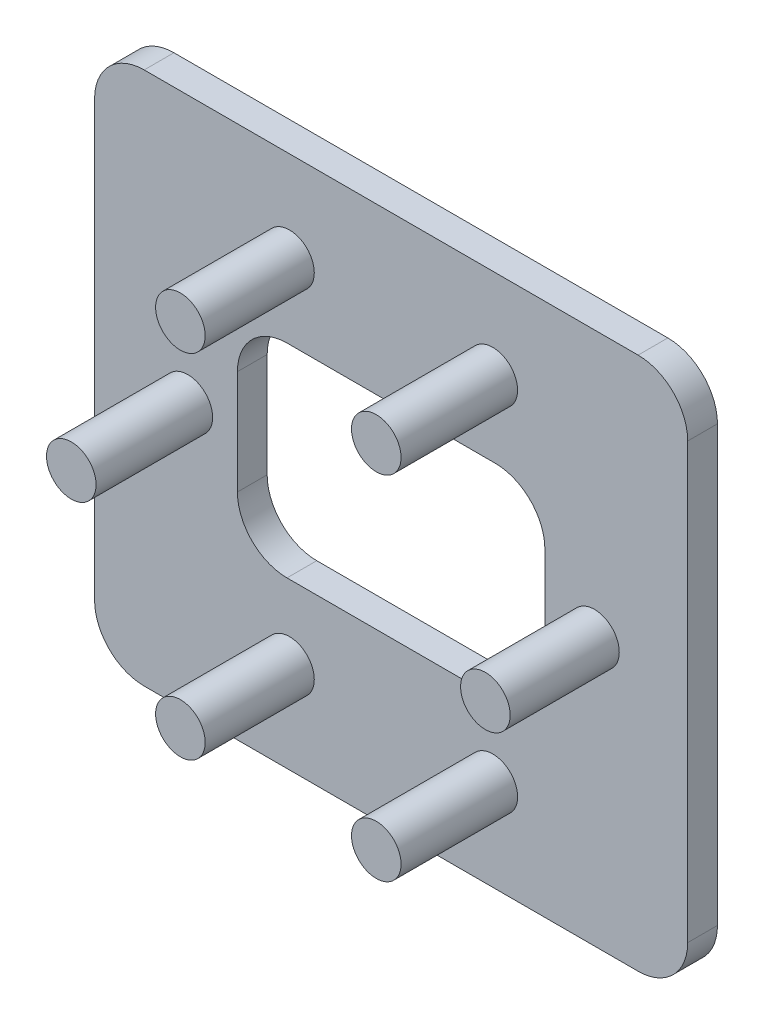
ISO-10303-21;
HEADER;
FILE_DESCRIPTION(('STEP AP214'),'2;1');
FILE_NAME('part.step','',(''),(''),'','','');
FILE_SCHEMA(('AUTOMOTIVE_DESIGN { 1 0 10303 214 1 1 1 1 }'));
ENDSEC;
DATA;
#1=APPLICATION_CONTEXT('core data for automotive mechanical design processes');
#2=APPLICATION_PROTOCOL_DEFINITION('international standard','automotive_design',2000,#1);
#3=PRODUCT_CONTEXT('',#1,'mechanical');
#4=PRODUCT('Part','Part','',(#3));
#5=PRODUCT_RELATED_PRODUCT_CATEGORY('part','',(#4));
#6=PRODUCT_DEFINITION_FORMATION('','',#4);
#7=PRODUCT_DEFINITION_CONTEXT('part definition',#1,'design');
#8=PRODUCT_DEFINITION('design','',#6,#7);
#9=PRODUCT_DEFINITION_SHAPE('','',#8);
#10=(LENGTH_UNIT() NAMED_UNIT(*) SI_UNIT(.MILLI.,.METRE.));
#11=(NAMED_UNIT(*) PLANE_ANGLE_UNIT() SI_UNIT($,.RADIAN.));
#12=(NAMED_UNIT(*) SI_UNIT($,.STERADIAN.) SOLID_ANGLE_UNIT());
#13=UNCERTAINTY_MEASURE_WITH_UNIT(LENGTH_MEASURE(1.E-05),#10,'distance_accuracy_value','');
#14=(GEOMETRIC_REPRESENTATION_CONTEXT(3) GLOBAL_UNCERTAINTY_ASSIGNED_CONTEXT((#13)) GLOBAL_UNIT_ASSIGNED_CONTEXT((#10,
#11,#12)) REPRESENTATION_CONTEXT('',''));
#15=CARTESIAN_POINT('',(0.,0.,0.));
#16=DIRECTION('',(0.,0.,1.));
#17=DIRECTION('',(1.,0.,0.));
#18=AXIS2_PLACEMENT_3D('',#15,#16,#17);
#19=CARTESIAN_POINT('',(-10.2500000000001,-17.7535207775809,14.));
#20=DIRECTION('',(0.,0.,-1.));
#21=DIRECTION('',(-1.,0.,0.));
#22=AXIS2_PLACEMENT_3D('',#19,#20,#21);
#23=CYLINDRICAL_SURFACE('',#22,2.5);
#24=CARTESIAN_POINT('',(-10.2500000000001,-17.7535207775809,14.));
#25=DIRECTION('',(0.,0.,1.));
#26=DIRECTION('',(1.,0.,0.));
#27=AXIS2_PLACEMENT_3D('',#24,#25,#26);
#28=CIRCLE('',#27,2.5);
#29=CARTESIAN_POINT('',(-7.75000000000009,-17.7535207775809,14.));
#30=VERTEX_POINT('',#29);
#31=EDGE_CURVE('E194',#30,#30,#28,.T.);
#32=ORIENTED_EDGE('',*,*,#31,.F.);
#33=EDGE_LOOP('',(#32));
#34=FACE_BOUND('',#33,.T.);
#35=CARTESIAN_POINT('',(-10.2500000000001,-17.7535207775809,0.));
#36=DIRECTION('',(0.,0.,1.));
#37=DIRECTION('',(1.,0.,0.));
#38=AXIS2_PLACEMENT_3D('',#35,#36,#37);
#39=CIRCLE('',#38,2.5);
#40=CARTESIAN_POINT('',(-7.75000000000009,-17.7535207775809,0.));
#41=VERTEX_POINT('',#40);
#42=EDGE_CURVE('E12',#41,#41,#39,.T.);
#43=ORIENTED_EDGE('',*,*,#42,.T.);
#44=EDGE_LOOP('',(#43));
#45=FACE_BOUND('',#44,.T.);
#46=ADVANCED_FACE('F190',(#34,#45),#23,.T.);
#47=CARTESIAN_POINT('',(-10.2500000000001,-17.7535207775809,14.));
#48=DIRECTION('',(0.,0.,1.));
#49=DIRECTION('',(1.,0.,0.));
#50=AXIS2_PLACEMENT_3D('',#47,#48,#49);
#51=PLANE('',#50);
#52=ORIENTED_EDGE('',*,*,#31,.T.);
#53=EDGE_LOOP('',(#52));
#54=FACE_BOUND('',#53,.T.);
#55=ADVANCED_FACE('F192',(#54),#51,.T.);
#56=CARTESIAN_POINT('',(-10.2500000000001,-17.7535207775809,0.));
#57=DIRECTION('',(0.,0.,1.));
#58=DIRECTION('',(1.,0.,0.));
#59=AXIS2_PLACEMENT_3D('',#56,#57,#58);
#60=PLANE('',#59);
#61=ORIENTED_EDGE('',*,*,#42,.F.);
#62=EDGE_LOOP('',(#61));
#63=FACE_BOUND('',#62,.T.);
#64=ADVANCED_FACE('F209',(#63),#60,.F.);
#65=CLOSED_SHELL('',(#46,#55,#64));
#66=MANIFOLD_SOLID_BREP('B2',#65);
#67=CARTESIAN_POINT('',(10.2500000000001,17.7535207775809,14.));
#68=DIRECTION('',(0.,0.,-1.));
#69=DIRECTION('',(-1.,0.,0.));
#70=AXIS2_PLACEMENT_3D('',#67,#68,#69);
#71=CYLINDRICAL_SURFACE('',#70,2.5);
#72=CARTESIAN_POINT('',(10.2500000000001,17.7535207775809,14.75));
#73=DIRECTION('',(0.,0.,1.));
#74=DIRECTION('',(1.,0.,0.));
#75=AXIS2_PLACEMENT_3D('',#72,#73,#74);
#76=CIRCLE('',#75,2.5);
#77=CARTESIAN_POINT('',(12.7500000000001,17.7535207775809,14.75));
#78=VERTEX_POINT('',#77);
#79=EDGE_CURVE('E252',#78,#78,#76,.T.);
#80=ORIENTED_EDGE('',*,*,#79,.F.);
#81=EDGE_LOOP('',(#80));
#82=FACE_BOUND('',#81,.T.);
#83=CARTESIAN_POINT('',(10.2500000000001,17.7535207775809,0.));
#84=DIRECTION('',(0.,0.,1.));
#85=DIRECTION('',(1.,0.,0.));
#86=AXIS2_PLACEMENT_3D('',#83,#84,#85);
#87=CIRCLE('',#86,2.5);
#88=CARTESIAN_POINT('',(12.7500000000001,17.7535207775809,0.));
#89=VERTEX_POINT('',#88);
#90=EDGE_CURVE('E189',#89,#89,#87,.T.);
#91=ORIENTED_EDGE('',*,*,#90,.T.);
#92=EDGE_LOOP('',(#91));
#93=FACE_BOUND('',#92,.T.);
#94=ADVANCED_FACE('F245',(#82,#93),#71,.T.);
#95=CARTESIAN_POINT('',(10.2500000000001,17.7535207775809,0.));
#96=DIRECTION('',(0.,0.,1.));
#97=DIRECTION('',(1.,0.,0.));
#98=AXIS2_PLACEMENT_3D('',#95,#96,#97);
#99=PLANE('',#98);
#100=ORIENTED_EDGE('',*,*,#90,.F.);
#101=EDGE_LOOP('',(#100));
#102=FACE_BOUND('',#101,.T.);
#103=ADVANCED_FACE('F247',(#102),#99,.F.);
#104=CARTESIAN_POINT('',(10.2500000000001,17.7535207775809,14.75));
#105=DIRECTION('',(0.,0.,1.));
#106=DIRECTION('',(1.,0.,0.));
#107=AXIS2_PLACEMENT_3D('',#104,#105,#106);
#108=PLANE('',#107);
#109=ORIENTED_EDGE('',*,*,#79,.T.);
#110=EDGE_LOOP('',(#109));
#111=FACE_BOUND('',#110,.T.);
#112=ADVANCED_FACE('F258',(#111),#108,.T.);
#113=CLOSED_SHELL('',(#94,#103,#112));
#114=MANIFOLD_SOLID_BREP('B7',#113);
#115=CARTESIAN_POINT('',(-10.2499999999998,17.7535207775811,14.));
#116=DIRECTION('',(0.,0.,-1.));
#117=DIRECTION('',(-1.,0.,0.));
#118=AXIS2_PLACEMENT_3D('',#115,#116,#117);
#119=CYLINDRICAL_SURFACE('',#118,2.5);
#120=CARTESIAN_POINT('',(-10.2499999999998,17.7535207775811,14.));
#121=DIRECTION('',(0.,0.,1.));
#122=DIRECTION('',(1.,0.,0.));
#123=AXIS2_PLACEMENT_3D('',#120,#121,#122);
#124=CIRCLE('',#123,2.5);
#125=CARTESIAN_POINT('',(-7.74999999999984,17.7535207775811,14.));
#126=VERTEX_POINT('',#125);
#127=EDGE_CURVE('E307',#126,#126,#124,.T.);
#128=ORIENTED_EDGE('',*,*,#127,.F.);
#129=EDGE_LOOP('',(#128));
#130=FACE_BOUND('',#129,.T.);
#131=CARTESIAN_POINT('',(-10.2499999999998,17.7535207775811,0.));
#132=DIRECTION('',(0.,0.,1.));
#133=DIRECTION('',(1.,0.,0.));
#134=AXIS2_PLACEMENT_3D('',#131,#132,#133);
#135=CIRCLE('',#134,2.5);
#136=CARTESIAN_POINT('',(-7.74999999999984,17.7535207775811,0.));
#137=VERTEX_POINT('',#136);
#138=EDGE_CURVE('E244',#137,#137,#135,.T.);
#139=ORIENTED_EDGE('',*,*,#138,.T.);
#140=EDGE_LOOP('',(#139));
#141=FACE_BOUND('',#140,.T.);
#142=ADVANCED_FACE('F303',(#130,#141),#119,.T.);
#143=CARTESIAN_POINT('',(-10.2499999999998,17.7535207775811,14.));
#144=DIRECTION('',(0.,0.,1.));
#145=DIRECTION('',(1.,0.,0.));
#146=AXIS2_PLACEMENT_3D('',#143,#144,#145);
#147=PLANE('',#146);
#148=ORIENTED_EDGE('',*,*,#127,.T.);
#149=EDGE_LOOP('',(#148));
#150=FACE_BOUND('',#149,.T.);
#151=ADVANCED_FACE('F305',(#150),#147,.T.);
#152=CARTESIAN_POINT('',(-10.2499999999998,17.7535207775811,0.));
#153=DIRECTION('',(0.,0.,1.));
#154=DIRECTION('',(1.,0.,0.));
#155=AXIS2_PLACEMENT_3D('',#152,#153,#154);
#156=PLANE('',#155);
#157=ORIENTED_EDGE('',*,*,#138,.F.);
#158=EDGE_LOOP('',(#157));
#159=FACE_BOUND('',#158,.T.);
#160=ADVANCED_FACE('F322',(#159),#156,.F.);
#161=CLOSED_SHELL('',(#142,#151,#160));
#162=MANIFOLD_SOLID_BREP('B184',#161);
#163=CARTESIAN_POINT('',(20.5,0.,14.));
#164=DIRECTION('',(0.,0.,-1.));
#165=DIRECTION('',(-1.,0.,0.));
#166=AXIS2_PLACEMENT_3D('',#163,#164,#165);
#167=CYLINDRICAL_SURFACE('',#166,2.5);
#168=CARTESIAN_POINT('',(20.5,0.,14.));
#169=DIRECTION('',(0.,0.,1.));
#170=DIRECTION('',(1.,0.,0.));
#171=AXIS2_PLACEMENT_3D('',#168,#169,#170);
#172=CIRCLE('',#171,2.5);
#173=CARTESIAN_POINT('',(23.,0.,14.));
#174=VERTEX_POINT('',#173);
#175=EDGE_CURVE('E362',#174,#174,#172,.T.);
#176=ORIENTED_EDGE('',*,*,#175,.F.);
#177=EDGE_LOOP('',(#176));
#178=FACE_BOUND('',#177,.T.);
#179=CARTESIAN_POINT('',(20.5,0.,0.));
#180=DIRECTION('',(0.,0.,1.));
#181=DIRECTION('',(1.,0.,0.));
#182=AXIS2_PLACEMENT_3D('',#179,#180,#181);
#183=CIRCLE('',#182,2.5);
#184=CARTESIAN_POINT('',(23.,0.,0.));
#185=VERTEX_POINT('',#184);
#186=EDGE_CURVE('E302',#185,#185,#183,.T.);
#187=ORIENTED_EDGE('',*,*,#186,.T.);
#188=EDGE_LOOP('',(#187));
#189=FACE_BOUND('',#188,.T.);
#190=ADVANCED_FACE('F358',(#178,#189),#167,.T.);
#191=CARTESIAN_POINT('',(0.,0.,14.));
#192=DIRECTION('',(0.,0.,1.));
#193=DIRECTION('',(1.,0.,0.));
#194=AXIS2_PLACEMENT_3D('',#191,#192,#193);
#195=PLANE('',#194);
#196=ORIENTED_EDGE('',*,*,#175,.T.);
#197=EDGE_LOOP('',(#196));
#198=FACE_BOUND('',#197,.T.);
#199=ADVANCED_FACE('F360',(#198),#195,.T.);
#200=CARTESIAN_POINT('',(0.,0.,0.));
#201=DIRECTION('',(0.,0.,1.));
#202=DIRECTION('',(1.,0.,0.));
#203=AXIS2_PLACEMENT_3D('',#200,#201,#202);
#204=PLANE('',#203);
#205=ORIENTED_EDGE('',*,*,#186,.F.);
#206=EDGE_LOOP('',(#205));
#207=FACE_BOUND('',#206,.T.);
#208=ADVANCED_FACE('F377',(#207),#204,.F.);
#209=CLOSED_SHELL('',(#190,#199,#208));
#210=MANIFOLD_SOLID_BREP('B239',#209);
#211=CARTESIAN_POINT('',(10.25,-17.7535207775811,14.));
#212=DIRECTION('',(0.,0.,-1.));
#213=DIRECTION('',(-1.,0.,0.));
#214=AXIS2_PLACEMENT_3D('',#211,#212,#213);
#215=CYLINDRICAL_SURFACE('',#214,2.50000000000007);
#216=CARTESIAN_POINT('',(10.25,-17.7535207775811,14.75));
#217=DIRECTION('',(0.,0.,1.));
#218=DIRECTION('',(1.,0.,0.));
#219=AXIS2_PLACEMENT_3D('',#216,#217,#218);
#220=CIRCLE('',#219,2.50000000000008);
#221=CARTESIAN_POINT('',(12.75,-17.7535207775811,14.75));
#222=VERTEX_POINT('',#221);
#223=EDGE_CURVE('E420',#222,#222,#220,.T.);
#224=ORIENTED_EDGE('',*,*,#223,.F.);
#225=EDGE_LOOP('',(#224));
#226=FACE_BOUND('',#225,.T.);
#227=CARTESIAN_POINT('',(10.25,-17.7535207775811,0.));
#228=DIRECTION('',(0.,0.,1.));
#229=DIRECTION('',(1.,0.,0.));
#230=AXIS2_PLACEMENT_3D('',#227,#228,#229);
#231=CIRCLE('',#230,2.50000000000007);
#232=CARTESIAN_POINT('',(12.75,-17.7535207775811,0.));
#233=VERTEX_POINT('',#232);
#234=EDGE_CURVE('E357',#233,#233,#231,.T.);
#235=ORIENTED_EDGE('',*,*,#234,.T.);
#236=EDGE_LOOP('',(#235));
#237=FACE_BOUND('',#236,.T.);
#238=ADVANCED_FACE('F413',(#226,#237),#215,.T.);
#239=CARTESIAN_POINT('',(0.,0.,0.));
#240=DIRECTION('',(0.,0.,1.));
#241=DIRECTION('',(1.,0.,0.));
#242=AXIS2_PLACEMENT_3D('',#239,#240,#241);
#243=PLANE('',#242);
#244=ORIENTED_EDGE('',*,*,#234,.F.);
#245=EDGE_LOOP('',(#244));
#246=FACE_BOUND('',#245,.T.);
#247=ADVANCED_FACE('F415',(#246),#243,.F.);
#248=CARTESIAN_POINT('',(10.25,-17.7535207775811,14.75));
#249=DIRECTION('',(0.,0.,1.));
#250=DIRECTION('',(1.,0.,0.));
#251=AXIS2_PLACEMENT_3D('',#248,#249,#250);
#252=PLANE('',#251);
#253=ORIENTED_EDGE('',*,*,#223,.T.);
#254=EDGE_LOOP('',(#253));
#255=FACE_BOUND('',#254,.T.);
#256=ADVANCED_FACE('F426',(#255),#252,.T.);
#257=CLOSED_SHELL('',(#238,#247,#256));
#258=MANIFOLD_SOLID_BREP('B297',#257);
#259=CARTESIAN_POINT('',(-20.5,0.,14.));
#260=DIRECTION('',(0.,0.,-1.));
#261=DIRECTION('',(-1.,0.,0.));
#262=AXIS2_PLACEMENT_3D('',#259,#260,#261);
#263=CYLINDRICAL_SURFACE('',#262,2.5);
#264=CARTESIAN_POINT('',(-20.5,0.,14.75));
#265=DIRECTION('',(0.,0.,1.));
#266=DIRECTION('',(1.,0.,0.));
#267=AXIS2_PLACEMENT_3D('',#264,#265,#266);
#268=CIRCLE('',#267,2.5);
#269=CARTESIAN_POINT('',(-18.,0.,14.75));
#270=VERTEX_POINT('',#269);
#271=EDGE_CURVE('E478',#270,#270,#268,.T.);
#272=ORIENTED_EDGE('',*,*,#271,.F.);
#273=EDGE_LOOP('',(#272));
#274=FACE_BOUND('',#273,.T.);
#275=CARTESIAN_POINT('',(-20.5,0.,0.));
#276=DIRECTION('',(0.,0.,1.));
#277=DIRECTION('',(1.,0.,0.));
#278=AXIS2_PLACEMENT_3D('',#275,#276,#277);
#279=CIRCLE('',#278,2.5);
#280=CARTESIAN_POINT('',(-18.,0.,0.));
#281=VERTEX_POINT('',#280);
#282=EDGE_CURVE('E412',#281,#281,#279,.T.);
#283=ORIENTED_EDGE('',*,*,#282,.T.);
#284=EDGE_LOOP('',(#283));
#285=FACE_BOUND('',#284,.T.);
#286=ADVANCED_FACE('F472',(#274,#285),#263,.T.);
#287=CARTESIAN_POINT('',(0.,0.,0.));
#288=DIRECTION('',(0.,0.,1.));
#289=DIRECTION('',(1.,0.,0.));
#290=AXIS2_PLACEMENT_3D('',#287,#288,#289);
#291=PLANE('',#290);
#292=ORIENTED_EDGE('',*,*,#282,.F.);
#293=EDGE_LOOP('',(#292));
#294=FACE_BOUND('',#293,.T.);
#295=ADVANCED_FACE('F487',(#294),#291,.F.);
#296=CARTESIAN_POINT('',(-20.5,0.,14.75));
#297=DIRECTION('',(0.,0.,1.));
#298=DIRECTION('',(1.,0.,0.));
#299=AXIS2_PLACEMENT_3D('',#296,#297,#298);
#300=PLANE('',#299);
#301=ORIENTED_EDGE('',*,*,#271,.T.);
#302=EDGE_LOOP('',(#301));
#303=FACE_BOUND('',#302,.T.);
#304=ADVANCED_FACE('F484',(#303),#300,.T.);
#305=CLOSED_SHELL('',(#286,#295,#304));
#306=MANIFOLD_SOLID_BREP('B352',#305);
#307=CARTESIAN_POINT('',(-29.9,-26.9,3.));
#308=DIRECTION('',(0.,1.,0.));
#309=DIRECTION('',(0.,0.,1.));
#310=AXIS2_PLACEMENT_3D('',#307,#308,#309);
#311=PLANE('',#310);
#312=DIRECTION('',(0.,0.,-1.));
#313=VECTOR('',#312,1.);
#314=CARTESIAN_POINT('',(24.9,-26.9,14.75));
#315=LINE('',#314,#313);
#316=CARTESIAN_POINT('',(24.9,-26.9,3.));
#317=VERTEX_POINT('',#316);
#318=CARTESIAN_POINT('',(24.9,-26.9,0.));
#319=VERTEX_POINT('',#318);
#320=EDGE_CURVE('E635',#317,#319,#315,.T.);
#321=ORIENTED_EDGE('',*,*,#320,.F.);
#322=DIRECTION('',(1.,0.,0.));
#323=VECTOR('',#322,1.);
#324=CARTESIAN_POINT('',(-29.9,-26.9,3.));
#325=LINE('',#324,#323);
#326=CARTESIAN_POINT('',(-24.9,-26.9,3.));
#327=VERTEX_POINT('',#326);
#328=EDGE_CURVE('E663',#327,#317,#325,.T.);
#329=ORIENTED_EDGE('',*,*,#328,.F.);
#330=DIRECTION('',(0.,0.,-1.));
#331=VECTOR('',#330,1.);
#332=CARTESIAN_POINT('',(-24.9,-26.9,14.75));
#333=LINE('',#332,#331);
#334=CARTESIAN_POINT('',(-24.9,-26.9,0.));
#335=VERTEX_POINT('',#334);
#336=EDGE_CURVE('E660',#335,#327,#333,.F.);
#337=ORIENTED_EDGE('',*,*,#336,.F.);
#338=DIRECTION('',(1.,0.,0.));
#339=VECTOR('',#338,1.);
#340=CARTESIAN_POINT('',(-29.9,-26.9,0.));
#341=LINE('',#340,#339);
#342=EDGE_CURVE('E654',#335,#319,#341,.T.);
#343=ORIENTED_EDGE('',*,*,#342,.T.);
#344=EDGE_LOOP('',(#321,#329,#337,#343));
#345=FACE_BOUND('',#344,.T.);
#346=ADVANCED_FACE('F522',(#345),#311,.F.);
#347=CARTESIAN_POINT('',(10.5,5.25352077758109,3.));
#348=DIRECTION('',(0.,0.,-1.));
#349=DIRECTION('',(-1.,0.,0.));
#350=AXIS2_PLACEMENT_3D('',#347,#348,#349);
#351=CYLINDRICAL_SURFACE('',#350,5.);
#352=CARTESIAN_POINT('',(10.5,5.25352077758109,0.));
#353=DIRECTION('',(0.,0.,1.));
#354=DIRECTION('',(1.,0.,0.));
#355=AXIS2_PLACEMENT_3D('',#352,#353,#354);
#356=CIRCLE('',#355,5.);
#357=CARTESIAN_POINT('',(10.5,10.2535207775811,0.));
#358=VERTEX_POINT('',#357);
#359=CARTESIAN_POINT('',(15.5,5.25352077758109,0.));
#360=VERTEX_POINT('',#359);
#361=EDGE_CURVE('E747',#358,#360,#356,.F.);
#362=ORIENTED_EDGE('',*,*,#361,.T.);
#363=DIRECTION('',(0.,0.,-1.));
#364=VECTOR('',#363,1.);
#365=CARTESIAN_POINT('',(15.5,5.25352077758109,3.));
#366=LINE('',#365,#364);
#367=CARTESIAN_POINT('',(15.5,5.25352077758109,3.));
#368=VERTEX_POINT('',#367);
#369=EDGE_CURVE('E777',#368,#360,#366,.T.);
#370=ORIENTED_EDGE('',*,*,#369,.F.);
#371=CARTESIAN_POINT('',(10.5,5.25352077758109,3.));
#372=DIRECTION('',(0.,0.,1.));
#373=DIRECTION('',(1.,0.,0.));
#374=AXIS2_PLACEMENT_3D('',#371,#372,#373);
#375=CIRCLE('',#374,5.);
#376=CARTESIAN_POINT('',(10.5,10.2535207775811,3.));
#377=VERTEX_POINT('',#376);
#378=EDGE_CURVE('E715',#377,#368,#375,.F.);
#379=ORIENTED_EDGE('',*,*,#378,.F.);
#380=DIRECTION('',(0.,0.,-1.));
#381=VECTOR('',#380,1.);
#382=CARTESIAN_POINT('',(10.5,10.2535207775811,3.));
#383=LINE('',#382,#381);
#384=EDGE_CURVE('E673',#377,#358,#383,.T.);
#385=ORIENTED_EDGE('',*,*,#384,.T.);
#386=EDGE_LOOP('',(#362,#370,#379,#385));
#387=FACE_BOUND('',#386,.T.);
#388=ADVANCED_FACE('F808',(#387),#351,.F.);
#389=CARTESIAN_POINT('',(15.5,0.,3.));
#390=DIRECTION('',(1.,0.,0.));
#391=DIRECTION('',(0.,0.,-1.));
#392=AXIS2_PLACEMENT_3D('',#389,#390,#391);
#393=PLANE('',#392);
#394=DIRECTION('',(0.,-1.,0.));
#395=VECTOR('',#394,1.);
#396=CARTESIAN_POINT('',(15.5,0.,0.));
#397=LINE('',#396,#395);
#398=CARTESIAN_POINT('',(15.5,-5.25352077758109,0.));
#399=VERTEX_POINT('',#398);
#400=EDGE_CURVE('E749',#360,#399,#397,.T.);
#401=ORIENTED_EDGE('',*,*,#400,.T.);
#402=DIRECTION('',(0.,0.,-1.));
#403=VECTOR('',#402,1.);
#404=CARTESIAN_POINT('',(15.5,-5.25352077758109,3.));
#405=LINE('',#404,#403);
#406=CARTESIAN_POINT('',(15.5,-5.25352077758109,3.));
#407=VERTEX_POINT('',#406);
#408=EDGE_CURVE('E775',#407,#399,#405,.T.);
#409=ORIENTED_EDGE('',*,*,#408,.F.);
#410=DIRECTION('',(0.,-1.,0.));
#411=VECTOR('',#410,1.);
#412=CARTESIAN_POINT('',(15.5,0.,3.));
#413=LINE('',#412,#411);
#414=EDGE_CURVE('E717',#368,#407,#413,.T.);
#415=ORIENTED_EDGE('',*,*,#414,.F.);
#416=ORIENTED_EDGE('',*,*,#369,.T.);
#417=EDGE_LOOP('',(#401,#409,#415,#416));
#418=FACE_BOUND('',#417,.T.);
#419=ADVANCED_FACE('F812',(#418),#393,.F.);
#420=CARTESIAN_POINT('',(10.5,-5.25352077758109,3.));
#421=DIRECTION('',(0.,0.,-1.));
#422=DIRECTION('',(-1.,0.,0.));
#423=AXIS2_PLACEMENT_3D('',#420,#421,#422);
#424=CYLINDRICAL_SURFACE('',#423,5.);
#425=CARTESIAN_POINT('',(10.5,-5.25352077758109,0.));
#426=DIRECTION('',(0.,0.,1.));
#427=DIRECTION('',(1.,0.,0.));
#428=AXIS2_PLACEMENT_3D('',#425,#426,#427);
#429=CIRCLE('',#428,5.);
#430=CARTESIAN_POINT('',(10.5,-10.2535207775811,0.));
#431=VERTEX_POINT('',#430);
#432=EDGE_CURVE('E752',#431,#399,#429,.T.);
#433=ORIENTED_EDGE('',*,*,#432,.F.);
#434=DIRECTION('',(0.,0.,-1.));
#435=VECTOR('',#434,1.);
#436=CARTESIAN_POINT('',(10.5,-10.2535207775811,3.));
#437=LINE('',#436,#435);
#438=CARTESIAN_POINT('',(10.5,-10.2535207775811,3.));
#439=VERTEX_POINT('',#438);
#440=EDGE_CURVE('E773',#439,#431,#437,.T.);
#441=ORIENTED_EDGE('',*,*,#440,.F.);
#442=CARTESIAN_POINT('',(10.5,-5.25352077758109,3.));
#443=DIRECTION('',(0.,0.,1.));
#444=DIRECTION('',(1.,0.,0.));
#445=AXIS2_PLACEMENT_3D('',#442,#443,#444);
#446=CIRCLE('',#445,5.);
#447=EDGE_CURVE('E719',#439,#407,#446,.T.);
#448=ORIENTED_EDGE('',*,*,#447,.T.);
#449=ORIENTED_EDGE('',*,*,#408,.T.);
#450=EDGE_LOOP('',(#433,#441,#448,#449));
#451=FACE_BOUND('',#450,.T.);
#452=ADVANCED_FACE('F842',(#451),#424,.F.);
#453=CARTESIAN_POINT('',(0.,-10.2535207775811,3.));
#454=DIRECTION('',(0.,1.,0.));
#455=DIRECTION('',(0.,0.,1.));
#456=AXIS2_PLACEMENT_3D('',#453,#454,#455);
#457=PLANE('',#456);
#458=DIRECTION('',(1.,0.,0.));
#459=VECTOR('',#458,1.);
#460=CARTESIAN_POINT('',(0.,-10.2535207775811,0.));
#461=LINE('',#460,#459);
#462=CARTESIAN_POINT('',(-10.5,-10.2535207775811,0.));
#463=VERTEX_POINT('',#462);
#464=EDGE_CURVE('E755',#463,#431,#461,.T.);
#465=ORIENTED_EDGE('',*,*,#464,.F.);
#466=DIRECTION('',(0.,0.,-1.));
#467=VECTOR('',#466,1.);
#468=CARTESIAN_POINT('',(-10.5,-10.2535207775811,3.));
#469=LINE('',#468,#467);
#470=CARTESIAN_POINT('',(-10.5,-10.2535207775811,3.));
#471=VERTEX_POINT('',#470);
#472=EDGE_CURVE('E771',#471,#463,#469,.T.);
#473=ORIENTED_EDGE('',*,*,#472,.F.);
#474=DIRECTION('',(1.,0.,0.));
#475=VECTOR('',#474,1.);
#476=CARTESIAN_POINT('',(0.,-10.2535207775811,3.));
#477=LINE('',#476,#475);
#478=EDGE_CURVE('E722',#471,#439,#477,.T.);
#479=ORIENTED_EDGE('',*,*,#478,.T.);
#480=ORIENTED_EDGE('',*,*,#440,.T.);
#481=EDGE_LOOP('',(#465,#473,#479,#480));
#482=FACE_BOUND('',#481,.T.);
#483=ADVANCED_FACE('F846',(#482),#457,.T.);
#484=CARTESIAN_POINT('',(-10.5,-5.25352077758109,3.));
#485=DIRECTION('',(0.,0.,-1.));
#486=DIRECTION('',(-1.,0.,0.));
#487=AXIS2_PLACEMENT_3D('',#484,#485,#486);
#488=CYLINDRICAL_SURFACE('',#487,5.);
#489=CARTESIAN_POINT('',(-10.5,-5.25352077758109,0.));
#490=DIRECTION('',(0.,0.,1.));
#491=DIRECTION('',(1.,0.,0.));
#492=AXIS2_PLACEMENT_3D('',#489,#490,#491);
#493=CIRCLE('',#492,5.);
#494=CARTESIAN_POINT('',(-15.5,-5.25352077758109,0.));
#495=VERTEX_POINT('',#494);
#496=EDGE_CURVE('E758',#495,#463,#493,.T.);
#497=ORIENTED_EDGE('',*,*,#496,.F.);
#498=DIRECTION('',(0.,0.,-1.));
#499=VECTOR('',#498,1.);
#500=CARTESIAN_POINT('',(-15.5,-5.25352077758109,3.));
#501=LINE('',#500,#499);
#502=CARTESIAN_POINT('',(-15.5,-5.25352077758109,3.));
#503=VERTEX_POINT('',#502);
#504=EDGE_CURVE('E769',#503,#495,#501,.T.);
#505=ORIENTED_EDGE('',*,*,#504,.F.);
#506=CARTESIAN_POINT('',(-10.5,-5.25352077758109,3.));
#507=DIRECTION('',(0.,0.,1.));
#508=DIRECTION('',(1.,0.,0.));
#509=AXIS2_PLACEMENT_3D('',#506,#507,#508);
#510=CIRCLE('',#509,5.);
#511=EDGE_CURVE('E725',#503,#471,#510,.T.);
#512=ORIENTED_EDGE('',*,*,#511,.T.);
#513=ORIENTED_EDGE('',*,*,#472,.T.);
#514=EDGE_LOOP('',(#497,#505,#512,#513));
#515=FACE_BOUND('',#514,.T.);
#516=ADVANCED_FACE('F850',(#515),#488,.F.);
#517=CARTESIAN_POINT('',(-15.5,0.,3.));
#518=DIRECTION('',(1.,0.,0.));
#519=DIRECTION('',(0.,0.,-1.));
#520=AXIS2_PLACEMENT_3D('',#517,#518,#519);
#521=PLANE('',#520);
#522=DIRECTION('',(0.,-1.,0.));
#523=VECTOR('',#522,1.);
#524=CARTESIAN_POINT('',(-15.5,0.,0.));
#525=LINE('',#524,#523);
#526=CARTESIAN_POINT('',(-15.5,5.25352077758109,0.));
#527=VERTEX_POINT('',#526);
#528=EDGE_CURVE('E761',#527,#495,#525,.T.);
#529=ORIENTED_EDGE('',*,*,#528,.F.);
#530=DIRECTION('',(0.,0.,-1.));
#531=VECTOR('',#530,1.);
#532=CARTESIAN_POINT('',(-15.5,5.25352077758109,3.));
#533=LINE('',#532,#531);
#534=CARTESIAN_POINT('',(-15.5,5.25352077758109,3.));
#535=VERTEX_POINT('',#534);
#536=EDGE_CURVE('E767',#535,#527,#533,.T.);
#537=ORIENTED_EDGE('',*,*,#536,.F.);
#538=DIRECTION('',(0.,-1.,0.));
#539=VECTOR('',#538,1.);
#540=CARTESIAN_POINT('',(-15.5,0.,3.));
#541=LINE('',#540,#539);
#542=EDGE_CURVE('E728',#535,#503,#541,.T.);
#543=ORIENTED_EDGE('',*,*,#542,.T.);
#544=ORIENTED_EDGE('',*,*,#504,.T.);
#545=EDGE_LOOP('',(#529,#537,#543,#544));
#546=FACE_BOUND('',#545,.T.);
#547=ADVANCED_FACE('F854',(#546),#521,.T.);
#548=CARTESIAN_POINT('',(-10.5,5.25352077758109,3.));
#549=DIRECTION('',(0.,0.,-1.));
#550=DIRECTION('',(-1.,0.,0.));
#551=AXIS2_PLACEMENT_3D('',#548,#549,#550);
#552=CYLINDRICAL_SURFACE('',#551,5.);
#553=CARTESIAN_POINT('',(-10.5,5.25352077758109,0.));
#554=DIRECTION('',(0.,0.,1.));
#555=DIRECTION('',(1.,0.,0.));
#556=AXIS2_PLACEMENT_3D('',#553,#554,#555);
#557=CIRCLE('',#556,5.);
#558=CARTESIAN_POINT('',(-10.5,10.2535207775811,0.));
#559=VERTEX_POINT('',#558);
#560=EDGE_CURVE('E706',#559,#527,#557,.T.);
#561=ORIENTED_EDGE('',*,*,#560,.F.);
#562=DIRECTION('',(0.,0.,-1.));
#563=VECTOR('',#562,1.);
#564=CARTESIAN_POINT('',(-10.5,10.2535207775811,3.));
#565=LINE('',#564,#563);
#566=CARTESIAN_POINT('',(-10.5,10.2535207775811,3.));
#567=VERTEX_POINT('',#566);
#568=EDGE_CURVE('E734',#567,#559,#565,.T.);
#569=ORIENTED_EDGE('',*,*,#568,.F.);
#570=CARTESIAN_POINT('',(-10.5,5.25352077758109,3.));
#571=DIRECTION('',(0.,0.,1.));
#572=DIRECTION('',(1.,0.,0.));
#573=AXIS2_PLACEMENT_3D('',#570,#571,#572);
#574=CIRCLE('',#573,5.);
#575=EDGE_CURVE('E731',#567,#535,#574,.T.);
#576=ORIENTED_EDGE('',*,*,#575,.T.);
#577=ORIENTED_EDGE('',*,*,#536,.T.);
#578=EDGE_LOOP('',(#561,#569,#576,#577));
#579=FACE_BOUND('',#578,.T.);
#580=ADVANCED_FACE('F837',(#579),#552,.F.);
#581=CARTESIAN_POINT('',(0.,10.2535207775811,3.));
#582=DIRECTION('',(0.,1.,0.));
#583=DIRECTION('',(0.,0.,1.));
#584=AXIS2_PLACEMENT_3D('',#581,#582,#583);
#585=PLANE('',#584);
#586=DIRECTION('',(1.,0.,0.));
#587=VECTOR('',#586,1.);
#588=CARTESIAN_POINT('',(0.,10.2535207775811,0.));
#589=LINE('',#588,#587);
#590=EDGE_CURVE('E744',#559,#358,#589,.T.);
#591=ORIENTED_EDGE('',*,*,#590,.T.);
#592=ORIENTED_EDGE('',*,*,#384,.F.);
#593=DIRECTION('',(1.,0.,0.));
#594=VECTOR('',#593,1.);
#595=CARTESIAN_POINT('',(0.,10.2535207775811,3.));
#596=LINE('',#595,#594);
#597=EDGE_CURVE('E712',#567,#377,#596,.T.);
#598=ORIENTED_EDGE('',*,*,#597,.F.);
#599=ORIENTED_EDGE('',*,*,#568,.T.);
#600=EDGE_LOOP('',(#591,#592,#598,#599));
#601=FACE_BOUND('',#600,.T.);
#602=ADVANCED_FACE('F834',(#601),#585,.F.);
#603=CARTESIAN_POINT('',(10.2500000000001,17.7535207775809,3.));
#604=DIRECTION('',(0.,0.,-1.));
#605=DIRECTION('',(-1.,0.,0.));
#606=AXIS2_PLACEMENT_3D('',#603,#604,#605);
#607=CYLINDRICAL_SURFACE('',#606,2.5);
#608=CARTESIAN_POINT('',(10.2500000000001,17.7535207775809,3.));
#609=DIRECTION('',(0.,0.,1.));
#610=DIRECTION('',(1.,0.,0.));
#611=AXIS2_PLACEMENT_3D('',#608,#609,#610);
#612=CIRCLE('',#611,2.5);
#613=CARTESIAN_POINT('',(12.7500000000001,17.7535207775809,3.));
#614=VERTEX_POINT('',#613);
#615=EDGE_CURVE('E709',#614,#614,#612,.T.);
#616=ORIENTED_EDGE('',*,*,#615,.T.);
#617=EDGE_LOOP('',(#616));
#618=FACE_BOUND('',#617,.T.);
#619=CARTESIAN_POINT('',(10.2500000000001,17.7535207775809,0.));
#620=DIRECTION('',(0.,0.,1.));
#621=DIRECTION('',(1.,0.,0.));
#622=AXIS2_PLACEMENT_3D('',#619,#620,#621);
#623=CIRCLE('',#622,2.5);
#624=CARTESIAN_POINT('',(12.7500000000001,17.7535207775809,0.));
#625=VERTEX_POINT('',#624);
#626=EDGE_CURVE('E741',#625,#625,#623,.T.);
#627=ORIENTED_EDGE('',*,*,#626,.F.);
#628=EDGE_LOOP('',(#627));
#629=FACE_BOUND('',#628,.T.);
#630=ADVANCED_FACE('F830',(#618,#629),#607,.F.);
#631=CARTESIAN_POINT('',(-10.2500000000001,-17.7535207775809,3.));
#632=DIRECTION('',(0.,0.,-1.));
#633=DIRECTION('',(-1.,0.,0.));
#634=AXIS2_PLACEMENT_3D('',#631,#632,#633);
#635=CYLINDRICAL_SURFACE('',#634,2.5);
#636=CARTESIAN_POINT('',(-10.2500000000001,-17.7535207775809,3.));
#637=DIRECTION('',(0.,0.,1.));
#638=DIRECTION('',(1.,0.,0.));
#639=AXIS2_PLACEMENT_3D('',#636,#637,#638);
#640=CIRCLE('',#639,2.5);
#641=CARTESIAN_POINT('',(-7.75000000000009,-17.7535207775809,3.));
#642=VERTEX_POINT('',#641);
#643=EDGE_CURVE('E705',#642,#642,#640,.T.);
#644=ORIENTED_EDGE('',*,*,#643,.T.);
#645=EDGE_LOOP('',(#644));
#646=FACE_BOUND('',#645,.T.);
#647=CARTESIAN_POINT('',(-10.2500000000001,-17.7535207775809,0.));
#648=DIRECTION('',(0.,0.,1.));
#649=DIRECTION('',(1.,0.,0.));
#650=AXIS2_PLACEMENT_3D('',#647,#648,#649);
#651=CIRCLE('',#650,2.5);
#652=CARTESIAN_POINT('',(-7.75000000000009,-17.7535207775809,0.));
#653=VERTEX_POINT('',#652);
#654=EDGE_CURVE('E738',#653,#653,#651,.T.);
#655=ORIENTED_EDGE('',*,*,#654,.F.);
#656=EDGE_LOOP('',(#655));
#657=FACE_BOUND('',#656,.T.);
#658=ADVANCED_FACE('F826',(#646,#657),#635,.F.);
#659=CARTESIAN_POINT('',(-10.2499999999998,17.7535207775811,3.));
#660=DIRECTION('',(0.,0.,-1.));
#661=DIRECTION('',(-1.,0.,0.));
#662=AXIS2_PLACEMENT_3D('',#659,#660,#661);
#663=CYLINDRICAL_SURFACE('',#662,2.5);
#664=CARTESIAN_POINT('',(-10.2499999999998,17.7535207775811,3.));
#665=DIRECTION('',(0.,0.,1.));
#666=DIRECTION('',(1.,0.,0.));
#667=AXIS2_PLACEMENT_3D('',#664,#665,#666);
#668=CIRCLE('',#667,2.5);
#669=CARTESIAN_POINT('',(-7.74999999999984,17.7535207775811,3.));
#670=VERTEX_POINT('',#669);
#671=EDGE_CURVE('E702',#670,#670,#668,.T.);
#672=ORIENTED_EDGE('',*,*,#671,.T.);
#673=EDGE_LOOP('',(#672));
#674=FACE_BOUND('',#673,.T.);
#675=CARTESIAN_POINT('',(-10.2499999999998,17.7535207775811,0.));
#676=DIRECTION('',(0.,0.,1.));
#677=DIRECTION('',(1.,0.,0.));
#678=AXIS2_PLACEMENT_3D('',#675,#676,#677);
#679=CIRCLE('',#678,2.5);
#680=CARTESIAN_POINT('',(-7.74999999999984,17.7535207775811,0.));
#681=VERTEX_POINT('',#680);
#682=EDGE_CURVE('E735',#681,#681,#679,.T.);
#683=ORIENTED_EDGE('',*,*,#682,.F.);
#684=EDGE_LOOP('',(#683));
#685=FACE_BOUND('',#684,.T.);
#686=ADVANCED_FACE('F823',(#674,#685),#663,.F.);
#687=CARTESIAN_POINT('',(0.,0.,0.));
#688=DIRECTION('',(0.,0.,1.));
#689=DIRECTION('',(1.,0.,0.));
#690=AXIS2_PLACEMENT_3D('',#687,#688,#689);
#691=PLANE('',#690);
#692=ORIENTED_EDGE('',*,*,#682,.T.);
#693=EDGE_LOOP('',(#692));
#694=FACE_BOUND('',#693,.T.);
#695=ORIENTED_EDGE('',*,*,#654,.T.);
#696=EDGE_LOOP('',(#695));
#697=FACE_BOUND('',#696,.T.);
#698=ORIENTED_EDGE('',*,*,#626,.T.);
#699=EDGE_LOOP('',(#698));
#700=FACE_BOUND('',#699,.T.);
#701=ORIENTED_EDGE('',*,*,#590,.F.);
#702=ORIENTED_EDGE('',*,*,#560,.T.);
#703=ORIENTED_EDGE('',*,*,#528,.T.);
#704=ORIENTED_EDGE('',*,*,#496,.T.);
#705=ORIENTED_EDGE('',*,*,#464,.T.);
#706=ORIENTED_EDGE('',*,*,#432,.T.);
#707=ORIENTED_EDGE('',*,*,#400,.F.);
#708=ORIENTED_EDGE('',*,*,#361,.F.);
#709=EDGE_LOOP('',(#701,#702,#703,#704,#705,#706,#707,#708));
#710=FACE_BOUND('',#709,.T.);
#711=DIRECTION('',(1.,0.,0.));
#712=VECTOR('',#711,1.);
#713=CARTESIAN_POINT('',(-29.9,26.9,0.));
#714=LINE('',#713,#712);
#715=CARTESIAN_POINT('',(-24.9,26.9,0.));
#716=VERTEX_POINT('',#715);
#717=CARTESIAN_POINT('',(24.9,26.9,0.));
#718=VERTEX_POINT('',#717);
#719=EDGE_CURVE('E661',#716,#718,#714,.T.);
#720=ORIENTED_EDGE('',*,*,#719,.T.);
#721=CARTESIAN_POINT('',(24.9,21.9,0.));
#722=DIRECTION('',(0.,0.,-1.));
#723=DIRECTION('',(-1.,0.,0.));
#724=AXIS2_PLACEMENT_3D('',#721,#722,#723);
#725=CIRCLE('',#724,5.);
#726=CARTESIAN_POINT('',(29.9,21.9,0.));
#727=VERTEX_POINT('',#726);
#728=EDGE_CURVE('E544',#727,#718,#725,.F.);
#729=ORIENTED_EDGE('',*,*,#728,.F.);
#730=DIRECTION('',(0.,-1.,0.));
#731=VECTOR('',#730,1.);
#732=CARTESIAN_POINT('',(29.9,0.,0.));
#733=LINE('',#732,#731);
#734=CARTESIAN_POINT('',(29.9,-21.9,0.));
#735=VERTEX_POINT('',#734);
#736=EDGE_CURVE('E656',#727,#735,#733,.T.);
#737=ORIENTED_EDGE('',*,*,#736,.T.);
#738=CARTESIAN_POINT('',(24.9,-21.9,0.));
#739=DIRECTION('',(0.,0.,-1.));
#740=DIRECTION('',(-1.,0.,0.));
#741=AXIS2_PLACEMENT_3D('',#738,#739,#740);
#742=CIRCLE('',#741,5.);
#743=EDGE_CURVE('E639',#735,#319,#742,.T.);
#744=ORIENTED_EDGE('',*,*,#743,.T.);
#745=ORIENTED_EDGE('',*,*,#342,.F.);
#746=CARTESIAN_POINT('',(-24.9,-21.9,0.));
#747=DIRECTION('',(0.,0.,-1.));
#748=DIRECTION('',(-1.,0.,0.));
#749=AXIS2_PLACEMENT_3D('',#746,#747,#748);
#750=CIRCLE('',#749,5.);
#751=CARTESIAN_POINT('',(-29.9,-21.9,0.));
#752=VERTEX_POINT('',#751);
#753=EDGE_CURVE('E784',#752,#335,#750,.F.);
#754=ORIENTED_EDGE('',*,*,#753,.F.);
#755=DIRECTION('',(0.,-1.,0.));
#756=VECTOR('',#755,1.);
#757=CARTESIAN_POINT('',(-29.9,0.,0.));
#758=LINE('',#757,#756);
#759=CARTESIAN_POINT('',(-29.9,21.9,0.));
#760=VERTEX_POINT('',#759);
#761=EDGE_CURVE('E785',#760,#752,#758,.T.);
#762=ORIENTED_EDGE('',*,*,#761,.F.);
#763=CARTESIAN_POINT('',(-24.9,21.9,0.));
#764=DIRECTION('',(0.,0.,-1.));
#765=DIRECTION('',(-1.,0.,0.));
#766=AXIS2_PLACEMENT_3D('',#763,#764,#765);
#767=CIRCLE('',#766,5.);
#768=EDGE_CURVE('E685',#760,#716,#767,.T.);
#769=ORIENTED_EDGE('',*,*,#768,.T.);
#770=EDGE_LOOP('',(#720,#729,#737,#744,#745,#754,#762,#769));
#771=FACE_BOUND('',#770,.T.);
#772=ADVANCED_FACE('F652',(#694,#697,#700,#710,#771),#691,.F.);
#773=CARTESIAN_POINT('',(0.,0.,3.));
#774=DIRECTION('',(0.,0.,1.));
#775=DIRECTION('',(1.,0.,0.));
#776=AXIS2_PLACEMENT_3D('',#773,#774,#775);
#777=PLANE('',#776);
#778=CARTESIAN_POINT('',(24.9,21.9,3.));
#779=DIRECTION('',(0.,0.,1.));
#780=DIRECTION('',(1.,0.,0.));
#781=AXIS2_PLACEMENT_3D('',#778,#779,#780);
#782=CIRCLE('',#781,5.);
#783=CARTESIAN_POINT('',(24.9,26.9,3.));
#784=VERTEX_POINT('',#783);
#785=CARTESIAN_POINT('',(29.9,21.9,3.));
#786=VERTEX_POINT('',#785);
#787=EDGE_CURVE('E694',#784,#786,#782,.F.);
#788=ORIENTED_EDGE('',*,*,#787,.F.);
#789=DIRECTION('',(1.,0.,0.));
#790=VECTOR('',#789,1.);
#791=CARTESIAN_POINT('',(-29.9,26.9,3.));
#792=LINE('',#791,#790);
#793=CARTESIAN_POINT('',(-24.9,26.9,3.));
#794=VERTEX_POINT('',#793);
#795=EDGE_CURVE('E668',#794,#784,#792,.T.);
#796=ORIENTED_EDGE('',*,*,#795,.F.);
#797=CARTESIAN_POINT('',(-24.9,21.9,3.));
#798=DIRECTION('',(0.,0.,1.));
#799=DIRECTION('',(1.,0.,0.));
#800=AXIS2_PLACEMENT_3D('',#797,#798,#799);
#801=CIRCLE('',#800,5.);
#802=CARTESIAN_POINT('',(-29.9,21.9,3.));
#803=VERTEX_POINT('',#802);
#804=EDGE_CURVE('E536',#794,#803,#801,.T.);
#805=ORIENTED_EDGE('',*,*,#804,.T.);
#806=DIRECTION('',(0.,1.,0.));
#807=VECTOR('',#806,1.);
#808=CARTESIAN_POINT('',(-29.9,0.,3.));
#809=LINE('',#808,#807);
#810=CARTESIAN_POINT('',(-29.9,-21.9,3.));
#811=VERTEX_POINT('',#810);
#812=EDGE_CURVE('E529',#811,#803,#809,.T.);
#813=ORIENTED_EDGE('',*,*,#812,.F.);
#814=CARTESIAN_POINT('',(-24.9,-21.9,3.));
#815=DIRECTION('',(0.,0.,1.));
#816=DIRECTION('',(1.,0.,0.));
#817=AXIS2_PLACEMENT_3D('',#814,#815,#816);
#818=CIRCLE('',#817,5.);
#819=EDGE_CURVE('E665',#327,#811,#818,.F.);
#820=ORIENTED_EDGE('',*,*,#819,.F.);
#821=ORIENTED_EDGE('',*,*,#328,.T.);
#822=CARTESIAN_POINT('',(24.9,-21.9,3.));
#823=DIRECTION('',(0.,0.,1.));
#824=DIRECTION('',(1.,0.,0.));
#825=AXIS2_PLACEMENT_3D('',#822,#823,#824);
#826=CIRCLE('',#825,5.);
#827=CARTESIAN_POINT('',(29.9,-21.9,3.));
#828=VERTEX_POINT('',#827);
#829=EDGE_CURVE('E642',#317,#828,#826,.T.);
#830=ORIENTED_EDGE('',*,*,#829,.T.);
#831=DIRECTION('',(0.,1.,0.));
#832=VECTOR('',#831,1.);
#833=CARTESIAN_POINT('',(29.9,0.,3.));
#834=LINE('',#833,#832);
#835=EDGE_CURVE('E470',#828,#786,#834,.T.);
#836=ORIENTED_EDGE('',*,*,#835,.T.);
#837=EDGE_LOOP('',(#788,#796,#805,#813,#820,#821,#830,#836));
#838=FACE_BOUND('',#837,.T.);
#839=ORIENTED_EDGE('',*,*,#671,.F.);
#840=EDGE_LOOP('',(#839));
#841=FACE_BOUND('',#840,.T.);
#842=ORIENTED_EDGE('',*,*,#643,.F.);
#843=EDGE_LOOP('',(#842));
#844=FACE_BOUND('',#843,.T.);
#845=ORIENTED_EDGE('',*,*,#615,.F.);
#846=EDGE_LOOP('',(#845));
#847=FACE_BOUND('',#846,.T.);
#848=ORIENTED_EDGE('',*,*,#597,.T.);
#849=ORIENTED_EDGE('',*,*,#378,.T.);
#850=ORIENTED_EDGE('',*,*,#414,.T.);
#851=ORIENTED_EDGE('',*,*,#447,.F.);
#852=ORIENTED_EDGE('',*,*,#478,.F.);
#853=ORIENTED_EDGE('',*,*,#511,.F.);
#854=ORIENTED_EDGE('',*,*,#542,.F.);
#855=ORIENTED_EDGE('',*,*,#575,.F.);
#856=EDGE_LOOP('',(#848,#849,#850,#851,#852,#853,#854,#855));
#857=FACE_BOUND('',#856,.T.);
#858=ADVANCED_FACE('F691',(#838,#841,#844,#847,#857),#777,.T.);
#859=CARTESIAN_POINT('',(-29.9,26.9,3.));
#860=DIRECTION('',(0.,1.,0.));
#861=DIRECTION('',(-1.,0.,0.));
#862=AXIS2_PLACEMENT_3D('',#859,#860,#861);
#863=PLANE('',#862);
#864=DIRECTION('',(0.,0.,-1.));
#865=VECTOR('',#864,1.);
#866=CARTESIAN_POINT('',(24.9,26.9,14.75));
#867=LINE('',#866,#865);
#868=EDGE_CURVE('E671',#718,#784,#867,.F.);
#869=ORIENTED_EDGE('',*,*,#868,.F.);
#870=ORIENTED_EDGE('',*,*,#719,.F.);
#871=DIRECTION('',(0.,0.,-1.));
#872=VECTOR('',#871,1.);
#873=CARTESIAN_POINT('',(-24.9,26.9,14.75));
#874=LINE('',#873,#872);
#875=EDGE_CURVE('E687',#794,#716,#874,.T.);
#876=ORIENTED_EDGE('',*,*,#875,.F.);
#877=ORIENTED_EDGE('',*,*,#795,.T.);
#878=EDGE_LOOP('',(#869,#870,#876,#877));
#879=FACE_BOUND('',#878,.T.);
#880=ADVANCED_FACE('F782',(#879),#863,.T.);
#881=CARTESIAN_POINT('',(-24.9,-21.9,14.75));
#882=DIRECTION('',(0.,0.,-1.));
#883=DIRECTION('',(-1.,0.,0.));
#884=AXIS2_PLACEMENT_3D('',#881,#882,#883);
#885=CYLINDRICAL_SURFACE('',#884,5.);
#886=ORIENTED_EDGE('',*,*,#819,.T.);
#887=DIRECTION('',(0.,0.,-1.));
#888=VECTOR('',#887,1.);
#889=CARTESIAN_POINT('',(-29.9,-21.9,14.75));
#890=LINE('',#889,#888);
#891=EDGE_CURVE('E657',#811,#752,#890,.T.);
#892=ORIENTED_EDGE('',*,*,#891,.T.);
#893=ORIENTED_EDGE('',*,*,#753,.T.);
#894=ORIENTED_EDGE('',*,*,#336,.T.);
#895=EDGE_LOOP('',(#886,#892,#893,#894));
#896=FACE_BOUND('',#895,.T.);
#897=ADVANCED_FACE('F791',(#896),#885,.T.);
#898=CARTESIAN_POINT('',(-29.9,0.,14.75));
#899=DIRECTION('',(1.,0.,0.));
#900=DIRECTION('',(0.,1.,0.));
#901=AXIS2_PLACEMENT_3D('',#898,#899,#900);
#902=PLANE('',#901);
#903=ORIENTED_EDGE('',*,*,#812,.T.);
#904=DIRECTION('',(0.,0.,-1.));
#905=VECTOR('',#904,1.);
#906=CARTESIAN_POINT('',(-29.9,21.9,14.75));
#907=LINE('',#906,#905);
#908=EDGE_CURVE('E679',#803,#760,#907,.T.);
#909=ORIENTED_EDGE('',*,*,#908,.T.);
#910=ORIENTED_EDGE('',*,*,#761,.T.);
#911=ORIENTED_EDGE('',*,*,#891,.F.);
#912=EDGE_LOOP('',(#903,#909,#910,#911));
#913=FACE_BOUND('',#912,.T.);
#914=ADVANCED_FACE('F677',(#913),#902,.F.);
#915=CARTESIAN_POINT('',(-24.9,21.9,14.75));
#916=DIRECTION('',(0.,0.,-1.));
#917=DIRECTION('',(-1.,0.,0.));
#918=AXIS2_PLACEMENT_3D('',#915,#916,#917);
#919=CYLINDRICAL_SURFACE('',#918,5.);
#920=ORIENTED_EDGE('',*,*,#875,.T.);
#921=ORIENTED_EDGE('',*,*,#768,.F.);
#922=ORIENTED_EDGE('',*,*,#908,.F.);
#923=ORIENTED_EDGE('',*,*,#804,.F.);
#924=EDGE_LOOP('',(#920,#921,#922,#923));
#925=FACE_BOUND('',#924,.T.);
#926=ADVANCED_FACE('F683',(#925),#919,.T.);
#927=CARTESIAN_POINT('',(24.9,21.9,14.75));
#928=DIRECTION('',(0.,0.,-1.));
#929=DIRECTION('',(-1.,0.,0.));
#930=AXIS2_PLACEMENT_3D('',#927,#928,#929);
#931=CYLINDRICAL_SURFACE('',#930,5.);
#932=ORIENTED_EDGE('',*,*,#787,.T.);
#933=DIRECTION('',(0.,0.,-1.));
#934=VECTOR('',#933,1.);
#935=CARTESIAN_POINT('',(29.9,21.9,14.75));
#936=LINE('',#935,#934);
#937=EDGE_CURVE('E695',#786,#727,#936,.T.);
#938=ORIENTED_EDGE('',*,*,#937,.T.);
#939=ORIENTED_EDGE('',*,*,#728,.T.);
#940=ORIENTED_EDGE('',*,*,#868,.T.);
#941=EDGE_LOOP('',(#932,#938,#939,#940));
#942=FACE_BOUND('',#941,.T.);
#943=ADVANCED_FACE('F798',(#942),#931,.T.);
#944=CARTESIAN_POINT('',(29.9,0.,14.75));
#945=DIRECTION('',(1.,0.,0.));
#946=DIRECTION('',(0.,1.,0.));
#947=AXIS2_PLACEMENT_3D('',#944,#945,#946);
#948=PLANE('',#947);
#949=DIRECTION('',(0.,0.,-1.));
#950=VECTOR('',#949,1.);
#951=CARTESIAN_POINT('',(29.9,-21.9,14.75));
#952=LINE('',#951,#950);
#953=EDGE_CURVE('E647',#828,#735,#952,.T.);
#954=ORIENTED_EDGE('',*,*,#953,.T.);
#955=ORIENTED_EDGE('',*,*,#736,.F.);
#956=ORIENTED_EDGE('',*,*,#937,.F.);
#957=ORIENTED_EDGE('',*,*,#835,.F.);
#958=EDGE_LOOP('',(#954,#955,#956,#957));
#959=FACE_BOUND('',#958,.T.);
#960=ADVANCED_FACE('F796',(#959),#948,.T.);
#961=CARTESIAN_POINT('',(24.9,-21.9,14.75));
#962=DIRECTION('',(0.,0.,-1.));
#963=DIRECTION('',(-1.,0.,0.));
#964=AXIS2_PLACEMENT_3D('',#961,#962,#963);
#965=CYLINDRICAL_SURFACE('',#964,5.);
#966=ORIENTED_EDGE('',*,*,#320,.T.);
#967=ORIENTED_EDGE('',*,*,#743,.F.);
#968=ORIENTED_EDGE('',*,*,#953,.F.);
#969=ORIENTED_EDGE('',*,*,#829,.F.);
#970=EDGE_LOOP('',(#966,#967,#968,#969));
#971=FACE_BOUND('',#970,.T.);
#972=ADVANCED_FACE('F637',(#971),#965,.T.);
#973=CLOSED_SHELL('',(#346,#388,#419,#452,#483,#516,#547,#580,#602,#630,#658,#686,#772,#858,
#880,#897,#914,#926,#943,#960,#972));
#974=MANIFOLD_SOLID_BREP('B407',#973);
#975=ADVANCED_BREP_SHAPE_REPRESENTATION('',(#18,#66,#114,#162,#210,#258,#306,#974),#14);
#976=SHAPE_DEFINITION_REPRESENTATION(#9,#975);
ENDSEC;
END-ISO-10303-21;
